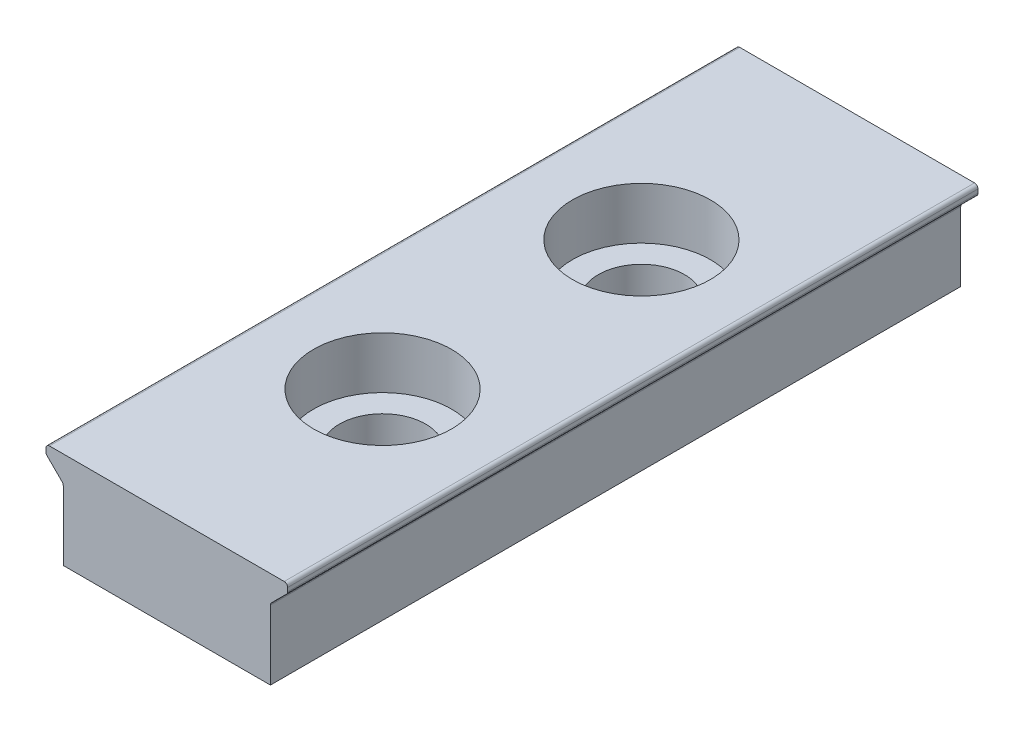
ISO-10303-21;
HEADER;
FILE_DESCRIPTION(('STEP AP214'),'2;1');
FILE_NAME('part.step','',(''),(''),'','','');
FILE_SCHEMA(('AUTOMOTIVE_DESIGN { 1 0 10303 214 1 1 1 1 }'));
ENDSEC;
DATA;
#1=APPLICATION_CONTEXT('core data for automotive mechanical design processes');
#2=APPLICATION_PROTOCOL_DEFINITION('international standard','automotive_design',2000,#1);
#3=PRODUCT_CONTEXT('',#1,'mechanical');
#4=PRODUCT('Part','Part','',(#3));
#5=PRODUCT_RELATED_PRODUCT_CATEGORY('part','',(#4));
#6=PRODUCT_DEFINITION_FORMATION('','',#4);
#7=PRODUCT_DEFINITION_CONTEXT('part definition',#1,'design');
#8=PRODUCT_DEFINITION('design','',#6,#7);
#9=PRODUCT_DEFINITION_SHAPE('','',#8);
#10=(LENGTH_UNIT() NAMED_UNIT(*) SI_UNIT(.MILLI.,.METRE.));
#11=(NAMED_UNIT(*) PLANE_ANGLE_UNIT() SI_UNIT($,.RADIAN.));
#12=(NAMED_UNIT(*) SI_UNIT($,.STERADIAN.) SOLID_ANGLE_UNIT());
#13=UNCERTAINTY_MEASURE_WITH_UNIT(LENGTH_MEASURE(1.E-05),#10,'distance_accuracy_value','');
#14=(GEOMETRIC_REPRESENTATION_CONTEXT(3) GLOBAL_UNCERTAINTY_ASSIGNED_CONTEXT((#13)) GLOBAL_UNIT_ASSIGNED_CONTEXT((#10,
#11,#12)) REPRESENTATION_CONTEXT('',''));
#15=CARTESIAN_POINT('',(0.,0.,0.));
#16=DIRECTION('',(0.,0.,1.));
#17=DIRECTION('',(1.,0.,0.));
#18=AXIS2_PLACEMENT_3D('',#15,#16,#17);
#19=CARTESIAN_POINT('',(0.,0.,20.));
#20=DIRECTION('',(0.,1.,0.));
#21=DIRECTION('',(0.,0.,1.));
#22=AXIS2_PLACEMENT_3D('',#19,#20,#21);
#23=PLANE('',#22);
#24=CARTESIAN_POINT('',(0.,0.,13.75));
#25=DIRECTION('',(0.,1.,0.));
#26=DIRECTION('',(0.,0.,1.));
#27=AXIS2_PLACEMENT_3D('',#24,#25,#26);
#28=CIRCLE('',#27,1.25);
#29=CARTESIAN_POINT('',(0.,0.,15.));
#30=VERTEX_POINT('',#29);
#31=EDGE_CURVE('E286',#30,#30,#28,.T.);
#32=ORIENTED_EDGE('',*,*,#31,.T.);
#33=EDGE_LOOP('',(#32));
#34=FACE_BOUND('',#33,.T.);
#35=CARTESIAN_POINT('',(0.,0.,6.25));
#36=DIRECTION('',(0.,1.,0.));
#37=DIRECTION('',(0.,0.,1.));
#38=AXIS2_PLACEMENT_3D('',#35,#36,#37);
#39=CIRCLE('',#38,1.25);
#40=CARTESIAN_POINT('',(0.,0.,7.5));
#41=VERTEX_POINT('',#40);
#42=EDGE_CURVE('E45',#41,#41,#39,.T.);
#43=ORIENTED_EDGE('',*,*,#42,.T.);
#44=EDGE_LOOP('',(#43));
#45=FACE_BOUND('',#44,.T.);
#46=DIRECTION('',(1.,0.,0.));
#47=VECTOR('',#46,1.);
#48=CARTESIAN_POINT('',(0.,0.,0.));
#49=LINE('',#48,#47);
#50=CARTESIAN_POINT('',(-3.00101,0.,0.));
#51=VERTEX_POINT('',#50);
#52=CARTESIAN_POINT('',(3.00101,0.,0.));
#53=VERTEX_POINT('',#52);
#54=EDGE_CURVE('E145',#51,#53,#49,.T.);
#55=ORIENTED_EDGE('',*,*,#54,.T.);
#56=DIRECTION('',(0.,0.,-1.));
#57=VECTOR('',#56,1.);
#58=CARTESIAN_POINT('',(3.00101,0.,20.));
#59=LINE('',#58,#57);
#60=CARTESIAN_POINT('',(3.00101,0.,20.));
#61=VERTEX_POINT('',#60);
#62=EDGE_CURVE('E202',#61,#53,#59,.T.);
#63=ORIENTED_EDGE('',*,*,#62,.F.);
#64=DIRECTION('',(1.,0.,0.));
#65=VECTOR('',#64,1.);
#66=CARTESIAN_POINT('',(0.,0.,20.));
#67=LINE('',#66,#65);
#68=CARTESIAN_POINT('',(-3.00101,0.,20.));
#69=VERTEX_POINT('',#68);
#70=EDGE_CURVE('E159',#69,#61,#67,.T.);
#71=ORIENTED_EDGE('',*,*,#70,.F.);
#72=DIRECTION('',(0.,0.,-1.));
#73=VECTOR('',#72,1.);
#74=CARTESIAN_POINT('',(-3.00101,0.,20.));
#75=LINE('',#74,#73);
#76=EDGE_CURVE('E156',#69,#51,#75,.T.);
#77=ORIENTED_EDGE('',*,*,#76,.T.);
#78=EDGE_LOOP('',(#55,#63,#71,#77));
#79=FACE_BOUND('',#78,.T.);
#80=ADVANCED_FACE('F42',(#34,#45,#79),#23,.F.);
#81=CARTESIAN_POINT('',(3.00101,2.05,20.));
#82=DIRECTION('',(-1.,0.,0.));
#83=DIRECTION('',(0.,-1.,0.));
#84=AXIS2_PLACEMENT_3D('',#81,#82,#83);
#85=PLANE('',#84);
#86=DIRECTION('',(0.,1.,0.));
#87=VECTOR('',#86,1.);
#88=CARTESIAN_POINT('',(3.00101,2.05,0.));
#89=LINE('',#88,#87);
#90=CARTESIAN_POINT('',(3.00101,2.00857864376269,0.));
#91=VERTEX_POINT('',#90);
#92=EDGE_CURVE('E152',#53,#91,#89,.T.);
#93=ORIENTED_EDGE('',*,*,#92,.T.);
#94=DIRECTION('',(0.,0.,-1.));
#95=VECTOR('',#94,1.);
#96=CARTESIAN_POINT('',(3.00101,2.00857864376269,20.));
#97=LINE('',#96,#95);
#98=CARTESIAN_POINT('',(3.00101,2.00857864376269,20.));
#99=VERTEX_POINT('',#98);
#100=EDGE_CURVE('E209',#91,#99,#97,.F.);
#101=ORIENTED_EDGE('',*,*,#100,.T.);
#102=DIRECTION('',(0.,1.,0.));
#103=VECTOR('',#102,1.);
#104=CARTESIAN_POINT('',(3.00101,2.05,20.));
#105=LINE('',#104,#103);
#106=EDGE_CURVE('E191',#61,#99,#105,.T.);
#107=ORIENTED_EDGE('',*,*,#106,.F.);
#108=ORIENTED_EDGE('',*,*,#62,.T.);
#109=EDGE_LOOP('',(#93,#101,#107,#108));
#110=FACE_BOUND('',#109,.T.);
#111=ADVANCED_FACE('F318',(#110),#85,.F.);
#112=CARTESIAN_POINT('',(3.50101,2.55,20.));
#113=DIRECTION('',(-0.707106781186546,0.707106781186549,0.));
#114=DIRECTION('',(-0.707106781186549,-0.707106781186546,0.));
#115=AXIS2_PLACEMENT_3D('',#112,#113,#114);
#116=PLANE('',#115);
#117=DIRECTION('',(0.707106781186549,0.707106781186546,0.));
#118=VECTOR('',#117,1.);
#119=CARTESIAN_POINT('',(3.50101,2.55,20.));
#120=LINE('',#119,#118);
#121=CARTESIAN_POINT('',(3.03029932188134,2.07928932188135,20.));
#122=VERTEX_POINT('',#121);
#123=CARTESIAN_POINT('',(3.47172067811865,2.52071067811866,20.));
#124=VERTEX_POINT('',#123);
#125=EDGE_CURVE('E194',#122,#124,#120,.T.);
#126=ORIENTED_EDGE('',*,*,#125,.F.);
#127=DIRECTION('',(0.,0.,-1.));
#128=VECTOR('',#127,1.);
#129=CARTESIAN_POINT('',(3.03029932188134,2.07928932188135,0.));
#130=LINE('',#129,#128);
#131=CARTESIAN_POINT('',(3.03029932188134,2.07928932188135,0.));
#132=VERTEX_POINT('',#131);
#133=EDGE_CURVE('E206',#122,#132,#130,.T.);
#134=ORIENTED_EDGE('',*,*,#133,.T.);
#135=DIRECTION('',(0.707106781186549,0.707106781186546,0.));
#136=VECTOR('',#135,1.);
#137=CARTESIAN_POINT('',(3.50101,2.55,0.));
#138=LINE('',#137,#136);
#139=CARTESIAN_POINT('',(3.47172067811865,2.52071067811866,0.));
#140=VERTEX_POINT('',#139);
#141=EDGE_CURVE('E182',#132,#140,#138,.T.);
#142=ORIENTED_EDGE('',*,*,#141,.T.);
#143=DIRECTION('',(0.,0.,-1.));
#144=VECTOR('',#143,1.);
#145=CARTESIAN_POINT('',(3.47172067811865,2.52071067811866,20.));
#146=LINE('',#145,#144);
#147=EDGE_CURVE('E204',#140,#124,#146,.F.);
#148=ORIENTED_EDGE('',*,*,#147,.T.);
#149=EDGE_LOOP('',(#126,#134,#142,#148));
#150=FACE_BOUND('',#149,.T.);
#151=ADVANCED_FACE('F323',(#150),#116,.F.);
#152=CARTESIAN_POINT('',(3.50101,2.8,20.));
#153=DIRECTION('',(-1.,0.,0.));
#154=DIRECTION('',(0.,-1.,0.));
#155=AXIS2_PLACEMENT_3D('',#152,#153,#154);
#156=PLANE('',#155);
#157=DIRECTION('',(0.,1.,0.));
#158=VECTOR('',#157,1.);
#159=CARTESIAN_POINT('',(3.50101,2.8,20.));
#160=LINE('',#159,#158);
#161=CARTESIAN_POINT('',(3.50101,2.59142135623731,20.));
#162=VERTEX_POINT('',#161);
#163=CARTESIAN_POINT('',(3.50101,2.7,20.));
#164=VERTEX_POINT('',#163);
#165=EDGE_CURVE('E197',#162,#164,#160,.T.);
#166=ORIENTED_EDGE('',*,*,#165,.F.);
#167=DIRECTION('',(0.,0.,-1.));
#168=VECTOR('',#167,1.);
#169=CARTESIAN_POINT('',(3.50101,2.59142135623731,20.));
#170=LINE('',#169,#168);
#171=CARTESIAN_POINT('',(3.50101,2.59142135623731,0.));
#172=VERTEX_POINT('',#171);
#173=EDGE_CURVE('E213',#162,#172,#170,.T.);
#174=ORIENTED_EDGE('',*,*,#173,.T.);
#175=DIRECTION('',(0.,1.,0.));
#176=VECTOR('',#175,1.);
#177=CARTESIAN_POINT('',(3.50101,2.8,0.));
#178=LINE('',#177,#176);
#179=CARTESIAN_POINT('',(3.50101,2.7,0.));
#180=VERTEX_POINT('',#179);
#181=EDGE_CURVE('E185',#172,#180,#178,.T.);
#182=ORIENTED_EDGE('',*,*,#181,.T.);
#183=DIRECTION('',(0.,0.,-1.));
#184=VECTOR('',#183,1.);
#185=CARTESIAN_POINT('',(3.50101,2.7,20.));
#186=LINE('',#185,#184);
#187=EDGE_CURVE('E211',#180,#164,#186,.F.);
#188=ORIENTED_EDGE('',*,*,#187,.T.);
#189=EDGE_LOOP('',(#166,#174,#182,#188));
#190=FACE_BOUND('',#189,.T.);
#191=ADVANCED_FACE('F298',(#190),#156,.F.);
#192=CARTESIAN_POINT('',(0.,2.8,20.));
#193=DIRECTION('',(0.,-1.,0.));
#194=DIRECTION('',(1.,0.,0.));
#195=AXIS2_PLACEMENT_3D('',#192,#193,#194);
#196=PLANE('',#195);
#197=CARTESIAN_POINT('',(0.,2.8,13.75));
#198=DIRECTION('',(0.,1.,0.));
#199=DIRECTION('',(0.,0.,1.));
#200=AXIS2_PLACEMENT_3D('',#197,#198,#199);
#201=CIRCLE('',#200,2.);
#202=CARTESIAN_POINT('',(0.,2.8,15.75));
#203=VERTEX_POINT('',#202);
#204=EDGE_CURVE('E289',#203,#203,#201,.T.);
#205=ORIENTED_EDGE('',*,*,#204,.F.);
#206=EDGE_LOOP('',(#205));
#207=FACE_BOUND('',#206,.T.);
#208=CARTESIAN_POINT('',(0.,2.8,6.25));
#209=DIRECTION('',(0.,1.,0.));
#210=DIRECTION('',(0.,0.,1.));
#211=AXIS2_PLACEMENT_3D('',#208,#209,#210);
#212=CIRCLE('',#211,2.);
#213=CARTESIAN_POINT('',(0.,2.8,8.25));
#214=VERTEX_POINT('',#213);
#215=EDGE_CURVE('E270',#214,#214,#212,.T.);
#216=ORIENTED_EDGE('',*,*,#215,.F.);
#217=EDGE_LOOP('',(#216));
#218=FACE_BOUND('',#217,.T.);
#219=DIRECTION('',(-1.,0.,0.));
#220=VECTOR('',#219,1.);
#221=CARTESIAN_POINT('',(0.,2.8,0.));
#222=LINE('',#221,#220);
#223=CARTESIAN_POINT('',(3.40101,2.8,0.));
#224=VERTEX_POINT('',#223);
#225=CARTESIAN_POINT('',(-3.40101,2.8,0.));
#226=VERTEX_POINT('',#225);
#227=EDGE_CURVE('E188',#224,#226,#222,.T.);
#228=ORIENTED_EDGE('',*,*,#227,.T.);
#229=DIRECTION('',(0.,0.,-1.));
#230=VECTOR('',#229,1.);
#231=CARTESIAN_POINT('',(-3.40101,2.8,20.));
#232=LINE('',#231,#230);
#233=CARTESIAN_POINT('',(-3.40101,2.8,20.));
#234=VERTEX_POINT('',#233);
#235=EDGE_CURVE('E57',#226,#234,#232,.F.);
#236=ORIENTED_EDGE('',*,*,#235,.T.);
#237=DIRECTION('',(-1.,0.,0.));
#238=VECTOR('',#237,1.);
#239=CARTESIAN_POINT('',(0.,2.8,20.));
#240=LINE('',#239,#238);
#241=CARTESIAN_POINT('',(3.40101,2.8,20.));
#242=VERTEX_POINT('',#241);
#243=EDGE_CURVE('E200',#242,#234,#240,.T.);
#244=ORIENTED_EDGE('',*,*,#243,.F.);
#245=DIRECTION('',(0.,0.,-1.));
#246=VECTOR('',#245,1.);
#247=CARTESIAN_POINT('',(3.40101,2.8,20.));
#248=LINE('',#247,#246);
#249=EDGE_CURVE('E224',#242,#224,#248,.T.);
#250=ORIENTED_EDGE('',*,*,#249,.T.);
#251=EDGE_LOOP('',(#228,#236,#244,#250));
#252=FACE_BOUND('',#251,.T.);
#253=ADVANCED_FACE('F295',(#207,#218,#252),#196,.F.);
#254=CARTESIAN_POINT('',(0.,0.,20.));
#255=DIRECTION('',(0.,0.,1.));
#256=DIRECTION('',(1.,0.,0.));
#257=AXIS2_PLACEMENT_3D('',#254,#255,#256);
#258=PLANE('',#257);
#259=DIRECTION('',(0.,1.,0.));
#260=VECTOR('',#259,1.);
#261=CARTESIAN_POINT('',(-3.50101,2.8,20.));
#262=LINE('',#261,#260);
#263=CARTESIAN_POINT('',(-3.50101,2.59142135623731,20.));
#264=VERTEX_POINT('',#263);
#265=CARTESIAN_POINT('',(-3.50101,2.7,20.));
#266=VERTEX_POINT('',#265);
#267=EDGE_CURVE('E169',#264,#266,#262,.T.);
#268=ORIENTED_EDGE('',*,*,#267,.F.);
#269=CARTESIAN_POINT('',(-3.40101,2.59142135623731,20.));
#270=DIRECTION('',(0.,0.,1.));
#271=DIRECTION('',(1.,0.,0.));
#272=AXIS2_PLACEMENT_3D('',#269,#270,#271);
#273=CIRCLE('',#272,0.1);
#274=CARTESIAN_POINT('',(-3.47172067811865,2.52071067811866,20.));
#275=VERTEX_POINT('',#274);
#276=EDGE_CURVE('E247',#264,#275,#273,.T.);
#277=ORIENTED_EDGE('',*,*,#276,.T.);
#278=DIRECTION('',(-0.707106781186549,0.707106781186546,0.));
#279=VECTOR('',#278,1.);
#280=CARTESIAN_POINT('',(-3.50101,2.55,20.));
#281=LINE('',#280,#279);
#282=CARTESIAN_POINT('',(-3.03029932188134,2.07928932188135,20.));
#283=VERTEX_POINT('',#282);
#284=EDGE_CURVE('E172',#283,#275,#281,.T.);
#285=ORIENTED_EDGE('',*,*,#284,.F.);
#286=CARTESIAN_POINT('',(-3.10101,2.00857864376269,20.));
#287=DIRECTION('',(0.,0.,1.));
#288=DIRECTION('',(1.,0.,0.));
#289=AXIS2_PLACEMENT_3D('',#286,#287,#288);
#290=CIRCLE('',#289,0.1);
#291=CARTESIAN_POINT('',(-3.00101,2.00857864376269,20.));
#292=VERTEX_POINT('',#291);
#293=EDGE_CURVE('E13',#283,#292,#290,.F.);
#294=ORIENTED_EDGE('',*,*,#293,.T.);
#295=DIRECTION('',(0.,1.,0.));
#296=VECTOR('',#295,1.);
#297=CARTESIAN_POINT('',(-3.00101,2.05,20.));
#298=LINE('',#297,#296);
#299=EDGE_CURVE('E163',#69,#292,#298,.T.);
#300=ORIENTED_EDGE('',*,*,#299,.F.);
#301=ORIENTED_EDGE('',*,*,#70,.T.);
#302=ORIENTED_EDGE('',*,*,#106,.T.);
#303=CARTESIAN_POINT('',(3.10101,2.00857864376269,20.));
#304=DIRECTION('',(0.,0.,1.));
#305=DIRECTION('',(1.,0.,0.));
#306=AXIS2_PLACEMENT_3D('',#303,#304,#305);
#307=CIRCLE('',#306,0.1);
#308=EDGE_CURVE('E229',#99,#122,#307,.F.);
#309=ORIENTED_EDGE('',*,*,#308,.T.);
#310=ORIENTED_EDGE('',*,*,#125,.T.);
#311=CARTESIAN_POINT('',(3.40101,2.59142135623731,20.));
#312=DIRECTION('',(0.,0.,1.));
#313=DIRECTION('',(1.,0.,0.));
#314=AXIS2_PLACEMENT_3D('',#311,#312,#313);
#315=CIRCLE('',#314,0.1);
#316=EDGE_CURVE('E222',#124,#162,#315,.T.);
#317=ORIENTED_EDGE('',*,*,#316,.T.);
#318=ORIENTED_EDGE('',*,*,#165,.T.);
#319=CARTESIAN_POINT('',(3.40101,2.7,20.));
#320=DIRECTION('',(0.,0.,1.));
#321=DIRECTION('',(1.,0.,0.));
#322=AXIS2_PLACEMENT_3D('',#319,#320,#321);
#323=CIRCLE('',#322,0.1);
#324=EDGE_CURVE('E220',#164,#242,#323,.T.);
#325=ORIENTED_EDGE('',*,*,#324,.T.);
#326=ORIENTED_EDGE('',*,*,#243,.T.);
#327=CARTESIAN_POINT('',(-3.40101,2.7,20.));
#328=DIRECTION('',(0.,0.,1.));
#329=DIRECTION('',(1.,0.,0.));
#330=AXIS2_PLACEMENT_3D('',#327,#328,#329);
#331=CIRCLE('',#330,0.1);
#332=EDGE_CURVE('E64',#234,#266,#331,.T.);
#333=ORIENTED_EDGE('',*,*,#332,.T.);
#334=EDGE_LOOP('',(#268,#277,#285,#294,#300,#301,#302,#309,#310,#317,#318,#325,#326,#333));
#335=FACE_BOUND('',#334,.T.);
#336=ADVANCED_FACE('F259',(#335),#258,.T.);
#337=CARTESIAN_POINT('',(0.,0.,0.));
#338=DIRECTION('',(0.,0.,1.));
#339=DIRECTION('',(1.,0.,0.));
#340=AXIS2_PLACEMENT_3D('',#337,#338,#339);
#341=PLANE('',#340);
#342=DIRECTION('',(-0.707106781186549,0.707106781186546,0.));
#343=VECTOR('',#342,1.);
#344=CARTESIAN_POINT('',(-3.50101,2.55,0.));
#345=LINE('',#344,#343);
#346=CARTESIAN_POINT('',(-3.03029932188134,2.07928932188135,0.));
#347=VERTEX_POINT('',#346);
#348=CARTESIAN_POINT('',(-3.47172067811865,2.52071067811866,0.));
#349=VERTEX_POINT('',#348);
#350=EDGE_CURVE('E170',#347,#349,#345,.T.);
#351=ORIENTED_EDGE('',*,*,#350,.T.);
#352=CARTESIAN_POINT('',(-3.40101,2.59142135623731,0.));
#353=DIRECTION('',(0.,0.,1.));
#354=DIRECTION('',(1.,0.,0.));
#355=AXIS2_PLACEMENT_3D('',#352,#353,#354);
#356=CIRCLE('',#355,0.1);
#357=CARTESIAN_POINT('',(-3.50101,2.59142135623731,0.));
#358=VERTEX_POINT('',#357);
#359=EDGE_CURVE('E239',#349,#358,#356,.F.);
#360=ORIENTED_EDGE('',*,*,#359,.T.);
#361=DIRECTION('',(0.,1.,0.));
#362=VECTOR('',#361,1.);
#363=CARTESIAN_POINT('',(-3.50101,2.8,0.));
#364=LINE('',#363,#362);
#365=CARTESIAN_POINT('',(-3.50101,2.7,0.));
#366=VERTEX_POINT('',#365);
#367=EDGE_CURVE('E174',#358,#366,#364,.T.);
#368=ORIENTED_EDGE('',*,*,#367,.T.);
#369=CARTESIAN_POINT('',(-3.40101,2.7,0.));
#370=DIRECTION('',(0.,0.,1.));
#371=DIRECTION('',(1.,0.,0.));
#372=AXIS2_PLACEMENT_3D('',#369,#370,#371);
#373=CIRCLE('',#372,0.1);
#374=EDGE_CURVE('E237',#366,#226,#373,.F.);
#375=ORIENTED_EDGE('',*,*,#374,.T.);
#376=ORIENTED_EDGE('',*,*,#227,.F.);
#377=CARTESIAN_POINT('',(3.40101,2.7,0.));
#378=DIRECTION('',(0.,0.,1.));
#379=DIRECTION('',(1.,0.,0.));
#380=AXIS2_PLACEMENT_3D('',#377,#378,#379);
#381=CIRCLE('',#380,0.1);
#382=EDGE_CURVE('E216',#224,#180,#381,.F.);
#383=ORIENTED_EDGE('',*,*,#382,.T.);
#384=ORIENTED_EDGE('',*,*,#181,.F.);
#385=CARTESIAN_POINT('',(3.40101,2.59142135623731,0.));
#386=DIRECTION('',(0.,0.,1.));
#387=DIRECTION('',(1.,0.,0.));
#388=AXIS2_PLACEMENT_3D('',#385,#386,#387);
#389=CIRCLE('',#388,0.1);
#390=EDGE_CURVE('E218',#172,#140,#389,.F.);
#391=ORIENTED_EDGE('',*,*,#390,.T.);
#392=ORIENTED_EDGE('',*,*,#141,.F.);
#393=CARTESIAN_POINT('',(3.10101,2.00857864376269,0.));
#394=DIRECTION('',(0.,0.,1.));
#395=DIRECTION('',(1.,0.,0.));
#396=AXIS2_PLACEMENT_3D('',#393,#394,#395);
#397=CIRCLE('',#396,0.1);
#398=EDGE_CURVE('E227',#132,#91,#397,.T.);
#399=ORIENTED_EDGE('',*,*,#398,.T.);
#400=ORIENTED_EDGE('',*,*,#92,.F.);
#401=ORIENTED_EDGE('',*,*,#54,.F.);
#402=DIRECTION('',(0.,1.,0.));
#403=VECTOR('',#402,1.);
#404=CARTESIAN_POINT('',(-3.00101,2.05,0.));
#405=LINE('',#404,#403);
#406=CARTESIAN_POINT('',(-3.00101,2.00857864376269,0.));
#407=VERTEX_POINT('',#406);
#408=EDGE_CURVE('E150',#51,#407,#405,.T.);
#409=ORIENTED_EDGE('',*,*,#408,.T.);
#410=CARTESIAN_POINT('',(-3.10101,2.00857864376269,0.));
#411=DIRECTION('',(0.,0.,1.));
#412=DIRECTION('',(1.,0.,0.));
#413=AXIS2_PLACEMENT_3D('',#410,#411,#412);
#414=CIRCLE('',#413,0.1);
#415=EDGE_CURVE('E50',#407,#347,#414,.T.);
#416=ORIENTED_EDGE('',*,*,#415,.T.);
#417=EDGE_LOOP('',(#351,#360,#368,#375,#376,#383,#384,#391,#392,#399,#400,#401,#409,#416));
#418=FACE_BOUND('',#417,.T.);
#419=ADVANCED_FACE('F148',(#418),#341,.F.);
#420=CARTESIAN_POINT('',(3.10101,2.00857864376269,20.));
#421=DIRECTION('',(0.,0.,1.));
#422=DIRECTION('',(1.,0.,0.));
#423=AXIS2_PLACEMENT_3D('',#420,#421,#422);
#424=CYLINDRICAL_SURFACE('',#423,0.1);
#425=ORIENTED_EDGE('',*,*,#308,.F.);
#426=ORIENTED_EDGE('',*,*,#100,.F.);
#427=ORIENTED_EDGE('',*,*,#398,.F.);
#428=ORIENTED_EDGE('',*,*,#133,.F.);
#429=EDGE_LOOP('',(#425,#426,#427,#428));
#430=FACE_BOUND('',#429,.T.);
#431=ADVANCED_FACE('F411',(#430),#424,.F.);
#432=CARTESIAN_POINT('',(3.40101,2.59142135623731,20.));
#433=DIRECTION('',(0.,0.,-1.));
#434=DIRECTION('',(-1.,0.,0.));
#435=AXIS2_PLACEMENT_3D('',#432,#433,#434);
#436=CYLINDRICAL_SURFACE('',#435,0.1);
#437=ORIENTED_EDGE('',*,*,#316,.F.);
#438=ORIENTED_EDGE('',*,*,#147,.F.);
#439=ORIENTED_EDGE('',*,*,#390,.F.);
#440=ORIENTED_EDGE('',*,*,#173,.F.);
#441=EDGE_LOOP('',(#437,#438,#439,#440));
#442=FACE_BOUND('',#441,.T.);
#443=ADVANCED_FACE('F419',(#442),#436,.T.);
#444=CARTESIAN_POINT('',(3.40101,2.7,20.));
#445=DIRECTION('',(0.,0.,-1.));
#446=DIRECTION('',(-1.,0.,0.));
#447=AXIS2_PLACEMENT_3D('',#444,#445,#446);
#448=CYLINDRICAL_SURFACE('',#447,0.1);
#449=ORIENTED_EDGE('',*,*,#324,.F.);
#450=ORIENTED_EDGE('',*,*,#187,.F.);
#451=ORIENTED_EDGE('',*,*,#382,.F.);
#452=ORIENTED_EDGE('',*,*,#249,.F.);
#453=EDGE_LOOP('',(#449,#450,#451,#452));
#454=FACE_BOUND('',#453,.T.);
#455=ADVANCED_FACE('F427',(#454),#448,.T.);
#456=CARTESIAN_POINT('',(-3.50101,2.8,20.));
#457=DIRECTION('',(-1.,0.,0.));
#458=DIRECTION('',(0.,-1.,0.));
#459=AXIS2_PLACEMENT_3D('',#456,#457,#458);
#460=PLANE('',#459);
#461=ORIENTED_EDGE('',*,*,#367,.F.);
#462=DIRECTION('',(0.,0.,-1.));
#463=VECTOR('',#462,1.);
#464=CARTESIAN_POINT('',(-3.50101,2.59142135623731,20.));
#465=LINE('',#464,#463);
#466=EDGE_CURVE('E244',#358,#264,#465,.F.);
#467=ORIENTED_EDGE('',*,*,#466,.T.);
#468=ORIENTED_EDGE('',*,*,#267,.T.);
#469=DIRECTION('',(0.,0.,-1.));
#470=VECTOR('',#469,1.);
#471=CARTESIAN_POINT('',(-3.50101,2.7,0.));
#472=LINE('',#471,#470);
#473=EDGE_CURVE('E241',#266,#366,#472,.T.);
#474=ORIENTED_EDGE('',*,*,#473,.T.);
#475=EDGE_LOOP('',(#461,#467,#468,#474));
#476=FACE_BOUND('',#475,.T.);
#477=ADVANCED_FACE('F267',(#476),#460,.T.);
#478=CARTESIAN_POINT('',(-3.50101,2.55,20.));
#479=DIRECTION('',(-0.707106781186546,-0.707106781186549,0.));
#480=DIRECTION('',(0.707106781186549,-0.707106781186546,0.));
#481=AXIS2_PLACEMENT_3D('',#478,#479,#480);
#482=PLANE('',#481);
#483=ORIENTED_EDGE('',*,*,#350,.F.);
#484=DIRECTION('',(0.,0.,-1.));
#485=VECTOR('',#484,1.);
#486=CARTESIAN_POINT('',(-3.03029932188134,2.07928932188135,20.));
#487=LINE('',#486,#485);
#488=EDGE_CURVE('E235',#347,#283,#487,.F.);
#489=ORIENTED_EDGE('',*,*,#488,.T.);
#490=ORIENTED_EDGE('',*,*,#284,.T.);
#491=DIRECTION('',(0.,0.,-1.));
#492=VECTOR('',#491,1.);
#493=CARTESIAN_POINT('',(-3.47172067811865,2.52071067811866,20.));
#494=LINE('',#493,#492);
#495=EDGE_CURVE('E232',#275,#349,#494,.T.);
#496=ORIENTED_EDGE('',*,*,#495,.T.);
#497=EDGE_LOOP('',(#483,#489,#490,#496));
#498=FACE_BOUND('',#497,.T.);
#499=ADVANCED_FACE('F254',(#498),#482,.T.);
#500=CARTESIAN_POINT('',(-3.00101,2.05,20.));
#501=DIRECTION('',(-1.,0.,0.));
#502=DIRECTION('',(0.,-1.,0.));
#503=AXIS2_PLACEMENT_3D('',#500,#501,#502);
#504=PLANE('',#503);
#505=ORIENTED_EDGE('',*,*,#299,.T.);
#506=DIRECTION('',(0.,0.,-1.));
#507=VECTOR('',#506,1.);
#508=CARTESIAN_POINT('',(-3.00101,2.00857864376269,0.));
#509=LINE('',#508,#507);
#510=EDGE_CURVE('E168',#292,#407,#509,.T.);
#511=ORIENTED_EDGE('',*,*,#510,.T.);
#512=ORIENTED_EDGE('',*,*,#408,.F.);
#513=ORIENTED_EDGE('',*,*,#76,.F.);
#514=EDGE_LOOP('',(#505,#511,#512,#513));
#515=FACE_BOUND('',#514,.T.);
#516=ADVANCED_FACE('F166',(#515),#504,.T.);
#517=CARTESIAN_POINT('',(-3.10101,2.00857864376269,20.));
#518=DIRECTION('',(0.,0.,1.));
#519=DIRECTION('',(1.,0.,0.));
#520=AXIS2_PLACEMENT_3D('',#517,#518,#519);
#521=CYLINDRICAL_SURFACE('',#520,0.1);
#522=ORIENTED_EDGE('',*,*,#293,.F.);
#523=ORIENTED_EDGE('',*,*,#488,.F.);
#524=ORIENTED_EDGE('',*,*,#415,.F.);
#525=ORIENTED_EDGE('',*,*,#510,.F.);
#526=EDGE_LOOP('',(#522,#523,#524,#525));
#527=FACE_BOUND('',#526,.T.);
#528=ADVANCED_FACE('F258',(#527),#521,.F.);
#529=CARTESIAN_POINT('',(-3.40101,2.59142135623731,20.));
#530=DIRECTION('',(0.,0.,-1.));
#531=DIRECTION('',(-1.,0.,0.));
#532=AXIS2_PLACEMENT_3D('',#529,#530,#531);
#533=CYLINDRICAL_SURFACE('',#532,0.1);
#534=ORIENTED_EDGE('',*,*,#276,.F.);
#535=ORIENTED_EDGE('',*,*,#466,.F.);
#536=ORIENTED_EDGE('',*,*,#359,.F.);
#537=ORIENTED_EDGE('',*,*,#495,.F.);
#538=EDGE_LOOP('',(#534,#535,#536,#537));
#539=FACE_BOUND('',#538,.T.);
#540=ADVANCED_FACE('F262',(#539),#533,.T.);
#541=CARTESIAN_POINT('',(-3.40101,2.7,20.));
#542=DIRECTION('',(0.,0.,1.));
#543=DIRECTION('',(1.,0.,0.));
#544=AXIS2_PLACEMENT_3D('',#541,#542,#543);
#545=CYLINDRICAL_SURFACE('',#544,0.1);
#546=ORIENTED_EDGE('',*,*,#332,.F.);
#547=ORIENTED_EDGE('',*,*,#235,.F.);
#548=ORIENTED_EDGE('',*,*,#374,.F.);
#549=ORIENTED_EDGE('',*,*,#473,.F.);
#550=EDGE_LOOP('',(#546,#547,#548,#549));
#551=FACE_BOUND('',#550,.T.);
#552=ADVANCED_FACE('F304',(#551),#545,.T.);
#553=CARTESIAN_POINT('',(0.,2.8,6.25));
#554=DIRECTION('',(0.,1.,0.));
#555=DIRECTION('',(0.,0.,1.));
#556=AXIS2_PLACEMENT_3D('',#553,#554,#555);
#557=CYLINDRICAL_SURFACE('',#556,1.25);
#558=CARTESIAN_POINT('',(0.,1.3,6.25));
#559=DIRECTION('',(0.,1.,0.));
#560=DIRECTION('',(0.,0.,1.));
#561=AXIS2_PLACEMENT_3D('',#558,#559,#560);
#562=CIRCLE('',#561,1.25);
#563=CARTESIAN_POINT('',(0.,1.3,7.5));
#564=VERTEX_POINT('',#563);
#565=EDGE_CURVE('E277',#564,#564,#562,.T.);
#566=ORIENTED_EDGE('',*,*,#565,.T.);
#567=EDGE_LOOP('',(#566));
#568=FACE_BOUND('',#567,.T.);
#569=ORIENTED_EDGE('',*,*,#42,.F.);
#570=EDGE_LOOP('',(#569));
#571=FACE_BOUND('',#570,.T.);
#572=ADVANCED_FACE('F306',(#568,#571),#557,.F.);
#573=CARTESIAN_POINT('',(0.,2.8,6.25));
#574=DIRECTION('',(0.,1.,0.));
#575=DIRECTION('',(0.,0.,1.));
#576=AXIS2_PLACEMENT_3D('',#573,#574,#575);
#577=CYLINDRICAL_SURFACE('',#576,2.);
#578=CARTESIAN_POINT('',(0.,1.3,6.25));
#579=DIRECTION('',(0.,1.,0.));
#580=DIRECTION('',(0.,0.,1.));
#581=AXIS2_PLACEMENT_3D('',#578,#579,#580);
#582=CIRCLE('',#581,2.);
#583=CARTESIAN_POINT('',(0.,1.3,8.25));
#584=VERTEX_POINT('',#583);
#585=EDGE_CURVE('E274',#584,#584,#582,.T.);
#586=ORIENTED_EDGE('',*,*,#585,.F.);
#587=EDGE_LOOP('',(#586));
#588=FACE_BOUND('',#587,.T.);
#589=ORIENTED_EDGE('',*,*,#215,.T.);
#590=EDGE_LOOP('',(#589));
#591=FACE_BOUND('',#590,.T.);
#592=ADVANCED_FACE('F312',(#588,#591),#577,.F.);
#593=CARTESIAN_POINT('',(1.25,1.3,6.25));
#594=DIRECTION('',(0.,-1.,0.));
#595=DIRECTION('',(0.,0.,-1.));
#596=AXIS2_PLACEMENT_3D('',#593,#594,#595);
#597=PLANE('',#596);
#598=ORIENTED_EDGE('',*,*,#565,.F.);
#599=EDGE_LOOP('',(#598));
#600=FACE_BOUND('',#599,.T.);
#601=ORIENTED_EDGE('',*,*,#585,.T.);
#602=EDGE_LOOP('',(#601));
#603=FACE_BOUND('',#602,.T.);
#604=ADVANCED_FACE('F332',(#600,#603),#597,.F.);
#605=CARTESIAN_POINT('',(0.,2.8,13.75));
#606=DIRECTION('',(0.,1.,0.));
#607=DIRECTION('',(0.,0.,1.));
#608=AXIS2_PLACEMENT_3D('',#605,#606,#607);
#609=CYLINDRICAL_SURFACE('',#608,1.25);
#610=CARTESIAN_POINT('',(0.,1.3,13.75));
#611=DIRECTION('',(0.,1.,0.));
#612=DIRECTION('',(0.,0.,1.));
#613=AXIS2_PLACEMENT_3D('',#610,#611,#612);
#614=CIRCLE('',#613,1.25);
#615=CARTESIAN_POINT('',(0.,1.3,15.));
#616=VERTEX_POINT('',#615);
#617=EDGE_CURVE('E283',#616,#616,#614,.T.);
#618=ORIENTED_EDGE('',*,*,#617,.T.);
#619=EDGE_LOOP('',(#618));
#620=FACE_BOUND('',#619,.T.);
#621=ORIENTED_EDGE('',*,*,#31,.F.);
#622=EDGE_LOOP('',(#621));
#623=FACE_BOUND('',#622,.T.);
#624=ADVANCED_FACE('F330',(#620,#623),#609,.F.);
#625=CARTESIAN_POINT('',(0.,2.8,13.75));
#626=DIRECTION('',(0.,1.,0.));
#627=DIRECTION('',(0.,0.,1.));
#628=AXIS2_PLACEMENT_3D('',#625,#626,#627);
#629=CYLINDRICAL_SURFACE('',#628,2.);
#630=CARTESIAN_POINT('',(0.,1.3,13.75));
#631=DIRECTION('',(0.,1.,0.));
#632=DIRECTION('',(0.,0.,1.));
#633=AXIS2_PLACEMENT_3D('',#630,#631,#632);
#634=CIRCLE('',#633,2.);
#635=CARTESIAN_POINT('',(0.,1.3,15.75));
#636=VERTEX_POINT('',#635);
#637=EDGE_CURVE('E280',#636,#636,#634,.T.);
#638=ORIENTED_EDGE('',*,*,#637,.F.);
#639=EDGE_LOOP('',(#638));
#640=FACE_BOUND('',#639,.T.);
#641=ORIENTED_EDGE('',*,*,#204,.T.);
#642=EDGE_LOOP('',(#641));
#643=FACE_BOUND('',#642,.T.);
#644=ADVANCED_FACE('F293',(#640,#643),#629,.F.);
#645=CARTESIAN_POINT('',(1.25,1.3,13.75));
#646=DIRECTION('',(0.,-1.,0.));
#647=DIRECTION('',(0.,0.,-1.));
#648=AXIS2_PLACEMENT_3D('',#645,#646,#647);
#649=PLANE('',#648);
#650=ORIENTED_EDGE('',*,*,#617,.F.);
#651=EDGE_LOOP('',(#650));
#652=FACE_BOUND('',#651,.T.);
#653=ORIENTED_EDGE('',*,*,#637,.T.);
#654=EDGE_LOOP('',(#653));
#655=FACE_BOUND('',#654,.T.);
#656=ADVANCED_FACE('F339',(#652,#655),#649,.F.);
#657=CLOSED_SHELL('',(#80,#111,#151,#191,#253,#336,#419,#431,#443,#455,#477,#499,#516,#528,#540,
#552,#572,#592,#604,#624,#644,#656));
#658=MANIFOLD_SOLID_BREP('B2',#657);
#659=ADVANCED_BREP_SHAPE_REPRESENTATION('',(#18,#658),#14);
#660=SHAPE_DEFINITION_REPRESENTATION(#9,#659);
ENDSEC;
END-ISO-10303-21;
